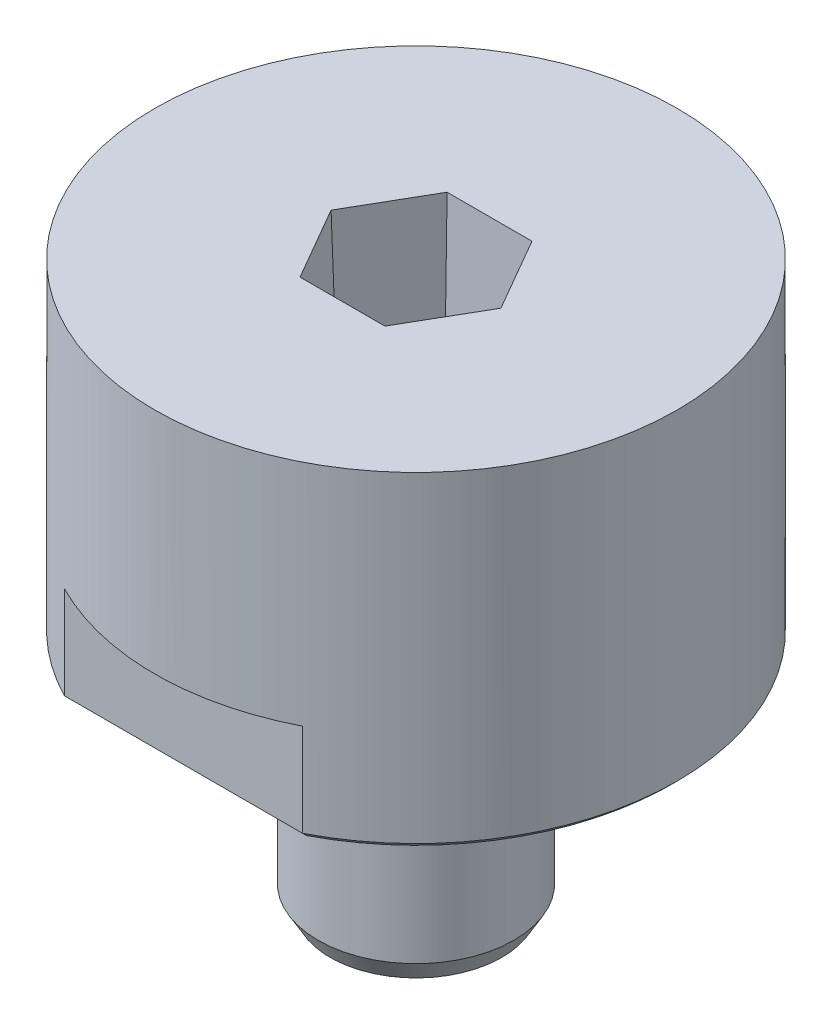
ISO-10303-21;
HEADER;
FILE_DESCRIPTION(('STEP AP214'),'2;1');
FILE_NAME('part.step','',(''),(''),'','','');
FILE_SCHEMA(('AUTOMOTIVE_DESIGN { 1 0 10303 214 1 1 1 1 }'));
ENDSEC;
DATA;
#1=APPLICATION_CONTEXT('core data for automotive mechanical design processes');
#2=APPLICATION_PROTOCOL_DEFINITION('international standard','automotive_design',2000,#1);
#3=PRODUCT_CONTEXT('',#1,'mechanical');
#4=PRODUCT('Part','Part','',(#3));
#5=PRODUCT_RELATED_PRODUCT_CATEGORY('part','',(#4));
#6=PRODUCT_DEFINITION_FORMATION('','',#4);
#7=PRODUCT_DEFINITION_CONTEXT('part definition',#1,'design');
#8=PRODUCT_DEFINITION('design','',#6,#7);
#9=PRODUCT_DEFINITION_SHAPE('','',#8);
#10=(LENGTH_UNIT() NAMED_UNIT(*) SI_UNIT(.MILLI.,.METRE.));
#11=(NAMED_UNIT(*) PLANE_ANGLE_UNIT() SI_UNIT($,.RADIAN.));
#12=(NAMED_UNIT(*) SI_UNIT($,.STERADIAN.) SOLID_ANGLE_UNIT());
#13=UNCERTAINTY_MEASURE_WITH_UNIT(LENGTH_MEASURE(1.E-05),#10,'distance_accuracy_value','');
#14=(GEOMETRIC_REPRESENTATION_CONTEXT(3) GLOBAL_UNCERTAINTY_ASSIGNED_CONTEXT((#13)) GLOBAL_UNIT_ASSIGNED_CONTEXT((#10,
#11,#12)) REPRESENTATION_CONTEXT('',''));
#15=CARTESIAN_POINT('',(0.,0.,0.));
#16=DIRECTION('',(0.,0.,1.));
#17=DIRECTION('',(1.,0.,0.));
#18=AXIS2_PLACEMENT_3D('',#15,#16,#17);
#19=CARTESIAN_POINT('',(0.,7.239,0.));
#20=DIRECTION('',(0.,1.,0.));
#21=DIRECTION('',(0.,0.,1.));
#22=AXIS2_PLACEMENT_3D('',#19,#20,#21);
#23=TOROIDAL_SURFACE('',#22,5.04821796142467,0.127);
#24=CARTESIAN_POINT('',(0.,7.112,0.));
#25=DIRECTION('',(0.,1.,0.));
#26=DIRECTION('',(0.,0.,1.));
#27=AXIS2_PLACEMENT_3D('',#24,#25,#26);
#28=CIRCLE('',#27,5.04821796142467);
#29=CARTESIAN_POINT('',(0.,7.112,5.04821796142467));
#30=VERTEX_POINT('',#29);
#31=EDGE_CURVE('E11',#30,#30,#28,.T.);
#32=ORIENTED_EDGE('',*,*,#31,.T.);
#33=EDGE_LOOP('',(#32));
#34=FACE_BOUND('',#33,.T.);
#35=CARTESIAN_POINT('',(0.,7.239,0.));
#36=DIRECTION('',(0.,1.,0.));
#37=DIRECTION('',(0.,0.,1.));
#38=AXIS2_PLACEMENT_3D('',#35,#36,#37);
#39=CIRCLE('',#38,5.17521796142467);
#40=CARTESIAN_POINT('',(0.,7.239,5.17521796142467));
#41=VERTEX_POINT('',#40);
#42=EDGE_CURVE('E71',#41,#41,#39,.T.);
#43=ORIENTED_EDGE('',*,*,#42,.F.);
#44=EDGE_LOOP('',(#43));
#45=FACE_BOUND('',#44,.T.);
#46=ADVANCED_FACE('F43',(#34,#45),#23,.T.);
#47=CARTESIAN_POINT('',(-5.04821796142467,7.112,0.));
#48=DIRECTION('',(0.,-1.,0.));
#49=DIRECTION('',(0.,0.,-1.));
#50=AXIS2_PLACEMENT_3D('',#47,#48,#49);
#51=PLANE('',#50);
#52=CARTESIAN_POINT('',(0.,7.112,0.));
#53=DIRECTION('',(0.,1.,0.));
#54=DIRECTION('',(0.,0.,1.));
#55=AXIS2_PLACEMENT_3D('',#52,#53,#54);
#56=CIRCLE('',#55,4.67183019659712);
#57=CARTESIAN_POINT('',(0.,7.112,4.67183019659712));
#58=VERTEX_POINT('',#57);
#59=EDGE_CURVE('E49',#58,#58,#56,.T.);
#60=ORIENTED_EDGE('',*,*,#59,.T.);
#61=EDGE_LOOP('',(#60));
#62=FACE_BOUND('',#61,.T.);
#63=ORIENTED_EDGE('',*,*,#31,.F.);
#64=EDGE_LOOP('',(#63));
#65=FACE_BOUND('',#64,.T.);
#66=ADVANCED_FACE('F79',(#62,#65),#51,.T.);
#67=CARTESIAN_POINT('',(0.,7.239,0.));
#68=DIRECTION('',(0.,1.,0.));
#69=DIRECTION('',(0.,0.,1.));
#70=AXIS2_PLACEMENT_3D('',#67,#68,#69);
#71=TOROIDAL_SURFACE('',#70,4.67183019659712,0.127);
#72=CARTESIAN_POINT('',(0.,7.239,0.));
#73=DIRECTION('',(0.,1.,0.));
#74=DIRECTION('',(0.,0.,1.));
#75=AXIS2_PLACEMENT_3D('',#72,#73,#74);
#76=CIRCLE('',#75,4.54483019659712);
#77=CARTESIAN_POINT('',(0.,7.239,4.54483019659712));
#78=VERTEX_POINT('',#77);
#79=EDGE_CURVE('E53',#78,#78,#76,.T.);
#80=ORIENTED_EDGE('',*,*,#79,.T.);
#81=EDGE_LOOP('',(#80));
#82=FACE_BOUND('',#81,.T.);
#83=ORIENTED_EDGE('',*,*,#59,.F.);
#84=EDGE_LOOP('',(#83));
#85=FACE_BOUND('',#84,.T.);
#86=ADVANCED_FACE('F83',(#82,#85),#71,.T.);
#87=CARTESIAN_POINT('',(0.,9.55248222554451,0.));
#88=DIRECTION('',(0.,1.,0.));
#89=DIRECTION('',(0.,0.,1.));
#90=AXIS2_PLACEMENT_3D('',#87,#88,#89);
#91=CYLINDRICAL_SURFACE('',#90,4.54483019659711);
#92=CARTESIAN_POINT('',(0.,7.4422,0.));
#93=DIRECTION('',(0.,1.,0.));
#94=DIRECTION('',(0.,0.,1.));
#95=AXIS2_PLACEMENT_3D('',#92,#93,#94);
#96=CIRCLE('',#95,4.54483019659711);
#97=CARTESIAN_POINT('',(0.,7.4422,4.54483019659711));
#98=VERTEX_POINT('',#97);
#99=EDGE_CURVE('E57',#98,#98,#96,.T.);
#100=ORIENTED_EDGE('',*,*,#99,.T.);
#101=EDGE_LOOP('',(#100));
#102=FACE_BOUND('',#101,.T.);
#103=ORIENTED_EDGE('',*,*,#79,.F.);
#104=EDGE_LOOP('',(#103));
#105=FACE_BOUND('',#104,.T.);
#106=ADVANCED_FACE('F87',(#102,#105),#91,.F.);
#107=CARTESIAN_POINT('',(0.,7.4422,0.));
#108=DIRECTION('',(0.,1.,0.));
#109=DIRECTION('',(0.,0.,1.));
#110=AXIS2_PLACEMENT_3D('',#107,#108,#109);
#111=TOROIDAL_SURFACE('',#110,4.67183019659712,0.127);
#112=CARTESIAN_POINT('',(0.,7.5692,0.));
#113=DIRECTION('',(0.,1.,0.));
#114=DIRECTION('',(0.,0.,1.));
#115=AXIS2_PLACEMENT_3D('',#112,#113,#114);
#116=CIRCLE('',#115,4.67183019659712);
#117=CARTESIAN_POINT('',(0.,7.5692,4.67183019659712));
#118=VERTEX_POINT('',#117);
#119=EDGE_CURVE('E62',#118,#118,#116,.T.);
#120=ORIENTED_EDGE('',*,*,#119,.T.);
#121=EDGE_LOOP('',(#120));
#122=FACE_BOUND('',#121,.T.);
#123=ORIENTED_EDGE('',*,*,#99,.F.);
#124=EDGE_LOOP('',(#123));
#125=FACE_BOUND('',#124,.T.);
#126=ADVANCED_FACE('F94',(#122,#125),#111,.T.);
#127=CARTESIAN_POINT('',(-4.67183019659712,7.5692,0.));
#128=DIRECTION('',(0.,1.,0.));
#129=DIRECTION('',(0.,0.,1.));
#130=AXIS2_PLACEMENT_3D('',#127,#128,#129);
#131=PLANE('',#130);
#132=CARTESIAN_POINT('',(0.,7.5692,0.));
#133=DIRECTION('',(0.,1.,0.));
#134=DIRECTION('',(0.,0.,1.));
#135=AXIS2_PLACEMENT_3D('',#132,#133,#134);
#136=CIRCLE('',#135,5.04821796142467);
#137=CARTESIAN_POINT('',(0.,7.5692,5.04821796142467));
#138=VERTEX_POINT('',#137);
#139=EDGE_CURVE('E65',#138,#138,#136,.T.);
#140=ORIENTED_EDGE('',*,*,#139,.T.);
#141=EDGE_LOOP('',(#140));
#142=FACE_BOUND('',#141,.T.);
#143=ORIENTED_EDGE('',*,*,#119,.F.);
#144=EDGE_LOOP('',(#143));
#145=FACE_BOUND('',#144,.T.);
#146=ADVANCED_FACE('F98',(#142,#145),#131,.T.);
#147=CARTESIAN_POINT('',(0.,7.4422,0.));
#148=DIRECTION('',(0.,1.,0.));
#149=DIRECTION('',(0.,0.,1.));
#150=AXIS2_PLACEMENT_3D('',#147,#148,#149);
#151=TOROIDAL_SURFACE('',#150,5.04821796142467,0.127);
#152=CARTESIAN_POINT('',(0.,7.4422,0.));
#153=DIRECTION('',(0.,1.,0.));
#154=DIRECTION('',(0.,0.,1.));
#155=AXIS2_PLACEMENT_3D('',#152,#153,#154);
#156=CIRCLE('',#155,5.17521796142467);
#157=CARTESIAN_POINT('',(0.,7.4422,5.17521796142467));
#158=VERTEX_POINT('',#157);
#159=EDGE_CURVE('E68',#158,#158,#156,.T.);
#160=ORIENTED_EDGE('',*,*,#159,.T.);
#161=EDGE_LOOP('',(#160));
#162=FACE_BOUND('',#161,.T.);
#163=ORIENTED_EDGE('',*,*,#139,.F.);
#164=EDGE_LOOP('',(#163));
#165=FACE_BOUND('',#164,.T.);
#166=ADVANCED_FACE('F102',(#162,#165),#151,.T.);
#167=CARTESIAN_POINT('',(0.,9.55248222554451,0.));
#168=DIRECTION('',(0.,1.,0.));
#169=DIRECTION('',(0.,0.,1.));
#170=AXIS2_PLACEMENT_3D('',#167,#168,#169);
#171=CYLINDRICAL_SURFACE('',#170,5.17521796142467);
#172=ORIENTED_EDGE('',*,*,#42,.T.);
#173=EDGE_LOOP('',(#172));
#174=FACE_BOUND('',#173,.T.);
#175=ORIENTED_EDGE('',*,*,#159,.F.);
#176=EDGE_LOOP('',(#175));
#177=FACE_BOUND('',#176,.T.);
#178=ADVANCED_FACE('F75',(#174,#177),#171,.T.);
#179=CLOSED_SHELL('',(#46,#66,#86,#106,#126,#146,#166,#178));
#180=MANIFOLD_SOLID_BREP('B2',#179);
#181=CARTESIAN_POINT('',(12.69746,27.305,0.));
#182=DIRECTION('',(0.,1.,0.));
#183=DIRECTION('',(0.,0.,1.));
#184=AXIS2_PLACEMENT_3D('',#181,#182,#183);
#185=PLANE('',#184);
#186=DIRECTION('',(0.5,0.,0.866025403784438));
#187=VECTOR('',#186,1.);
#188=CARTESIAN_POINT('',(6.2696648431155,27.305,3.71108926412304));
#189=LINE('',#188,#187);
#190=CARTESIAN_POINT('',(4.12706645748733,27.305,0.));
#191=VERTEX_POINT('',#190);
#192=CARTESIAN_POINT('',(2.06353322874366,27.305,-3.57414439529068));
#193=VERTEX_POINT('',#192);
#194=EDGE_CURVE('E244',#191,#193,#189,.F.);
#195=ORIENTED_EDGE('',*,*,#194,.F.);
#196=DIRECTION('',(-0.5,0.,0.866025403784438));
#197=VECTOR('',#196,1.);
#198=CARTESIAN_POINT('',(6.2696648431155,27.305,-3.71108926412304));
#199=LINE('',#198,#197);
#200=CARTESIAN_POINT('',(2.06353322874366,27.305,3.57414439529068));
#201=VERTEX_POINT('',#200);
#202=EDGE_CURVE('E237',#201,#191,#199,.F.);
#203=ORIENTED_EDGE('',*,*,#202,.F.);
#204=DIRECTION('',(-1.,0.,0.));
#205=VECTOR('',#204,1.);
#206=CARTESIAN_POINT('',(12.69746,27.305,3.57414439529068));
#207=LINE('',#206,#205);
#208=CARTESIAN_POINT('',(-2.06353322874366,27.305,3.57414439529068));
#209=VERTEX_POINT('',#208);
#210=EDGE_CURVE('E168',#209,#201,#207,.F.);
#211=ORIENTED_EDGE('',*,*,#210,.F.);
#212=DIRECTION('',(-0.5,0.,-0.866025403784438));
#213=VECTOR('',#212,1.);
#214=CARTESIAN_POINT('',(0.0790651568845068,27.305,7.28523365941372));
#215=LINE('',#214,#213);
#216=CARTESIAN_POINT('',(-4.12706645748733,27.305,0.));
#217=VERTEX_POINT('',#216);
#218=EDGE_CURVE('E227',#217,#209,#215,.F.);
#219=ORIENTED_EDGE('',*,*,#218,.F.);
#220=DIRECTION('',(0.5,0.,-0.866025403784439));
#221=VECTOR('',#220,1.);
#222=CARTESIAN_POINT('',(0.0790651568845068,27.305,-7.28523365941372));
#223=LINE('',#222,#221);
#224=CARTESIAN_POINT('',(-2.06353322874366,27.305,-3.57414439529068));
#225=VERTEX_POINT('',#224);
#226=EDGE_CURVE('E233',#225,#217,#223,.F.);
#227=ORIENTED_EDGE('',*,*,#226,.F.);
#228=DIRECTION('',(1.,0.,0.));
#229=VECTOR('',#228,1.);
#230=CARTESIAN_POINT('',(12.69746,27.305,-3.57414439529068));
#231=LINE('',#230,#229);
#232=EDGE_CURVE('E246',#193,#225,#231,.F.);
#233=ORIENTED_EDGE('',*,*,#232,.F.);
#234=EDGE_LOOP('',(#195,#203,#211,#219,#227,#233));
#235=FACE_BOUND('',#234,.T.);
#236=CARTESIAN_POINT('',(0.,27.305,0.));
#237=DIRECTION('',(0.,-1.,0.));
#238=DIRECTION('',(0.,0.,-1.));
#239=AXIS2_PLACEMENT_3D('',#236,#237,#238);
#240=CIRCLE('',#239,12.69746);
#241=CARTESIAN_POINT('',(0.,27.305,-12.69746));
#242=VERTEX_POINT('',#241);
#243=EDGE_CURVE('E457',#242,#242,#240,.T.);
#244=ORIENTED_EDGE('',*,*,#243,.F.);
#245=EDGE_LOOP('',(#244));
#246=FACE_BOUND('',#245,.T.);
#247=ADVANCED_FACE('F164',(#235,#246),#185,.T.);
#248=CARTESIAN_POINT('',(0.,0.,0.));
#249=DIRECTION('',(0.,-1.,0.));
#250=DIRECTION('',(0.,0.,-1.));
#251=AXIS2_PLACEMENT_3D('',#248,#249,#250);
#252=CYLINDRICAL_SURFACE('',#251,12.69746);
#253=DIRECTION('',(0.,-1.,0.));
#254=VECTOR('',#253,1.);
#255=CARTESIAN_POINT('',(-5.78512588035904,16.1925,-11.303));
#256=LINE('',#255,#254);
#257=CARTESIAN_POINT('',(-5.78512588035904,16.1925,-11.303));
#258=VERTEX_POINT('',#257);
#259=CARTESIAN_POINT('',(-5.78512588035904,11.684,-11.303));
#260=VERTEX_POINT('',#259);
#261=EDGE_CURVE('E417',#258,#260,#256,.T.);
#262=ORIENTED_EDGE('',*,*,#261,.T.);
#263=CARTESIAN_POINT('',(0.,11.684,0.));
#264=DIRECTION('',(0.,-1.,0.));
#265=DIRECTION('',(0.,0.,-1.));
#266=AXIS2_PLACEMENT_3D('',#263,#264,#265);
#267=CIRCLE('',#266,12.69746);
#268=CARTESIAN_POINT('',(-5.78512588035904,11.684,11.303));
#269=VERTEX_POINT('',#268);
#270=EDGE_CURVE('E174',#260,#269,#267,.F.);
#271=ORIENTED_EDGE('',*,*,#270,.T.);
#272=DIRECTION('',(0.,-1.,0.));
#273=VECTOR('',#272,1.);
#274=CARTESIAN_POINT('',(-5.78512588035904,16.1925,11.303));
#275=LINE('',#274,#273);
#276=CARTESIAN_POINT('',(-5.78512588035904,16.1925,11.303));
#277=VERTEX_POINT('',#276);
#278=EDGE_CURVE('E420',#277,#269,#275,.T.);
#279=ORIENTED_EDGE('',*,*,#278,.F.);
#280=CARTESIAN_POINT('',(0.,16.1925,0.));
#281=DIRECTION('',(0.,-1.,0.));
#282=DIRECTION('',(0.,0.,-1.));
#283=AXIS2_PLACEMENT_3D('',#280,#281,#282);
#284=CIRCLE('',#283,12.69746);
#285=CARTESIAN_POINT('',(5.78512588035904,16.1925,11.303));
#286=VERTEX_POINT('',#285);
#287=EDGE_CURVE('E414',#286,#277,#284,.T.);
#288=ORIENTED_EDGE('',*,*,#287,.F.);
#289=DIRECTION('',(0.,-1.,0.));
#290=VECTOR('',#289,1.);
#291=CARTESIAN_POINT('',(5.78512588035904,16.1925,11.303));
#292=LINE('',#291,#290);
#293=CARTESIAN_POINT('',(5.78512588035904,11.684,11.303));
#294=VERTEX_POINT('',#293);
#295=EDGE_CURVE('E421',#286,#294,#292,.T.);
#296=ORIENTED_EDGE('',*,*,#295,.T.);
#297=CARTESIAN_POINT('',(0.,11.684,0.));
#298=DIRECTION('',(0.,-1.,0.));
#299=DIRECTION('',(0.,0.,-1.));
#300=AXIS2_PLACEMENT_3D('',#297,#298,#299);
#301=CIRCLE('',#300,12.69746);
#302=CARTESIAN_POINT('',(5.78512588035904,11.684,-11.303));
#303=VERTEX_POINT('',#302);
#304=EDGE_CURVE('E469',#294,#303,#301,.F.);
#305=ORIENTED_EDGE('',*,*,#304,.T.);
#306=DIRECTION('',(0.,-1.,0.));
#307=VECTOR('',#306,1.);
#308=CARTESIAN_POINT('',(5.78512588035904,16.1925,-11.303));
#309=LINE('',#308,#307);
#310=CARTESIAN_POINT('',(5.78512588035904,16.1925,-11.303));
#311=VERTEX_POINT('',#310);
#312=EDGE_CURVE('E430',#311,#303,#309,.T.);
#313=ORIENTED_EDGE('',*,*,#312,.F.);
#314=CARTESIAN_POINT('',(0.,16.1925,0.));
#315=DIRECTION('',(0.,-1.,0.));
#316=DIRECTION('',(0.,0.,-1.));
#317=AXIS2_PLACEMENT_3D('',#314,#315,#316);
#318=CIRCLE('',#317,12.69746);
#319=EDGE_CURVE('E254',#258,#311,#318,.T.);
#320=ORIENTED_EDGE('',*,*,#319,.F.);
#321=EDGE_LOOP('',(#262,#271,#279,#288,#296,#305,#313,#320));
#322=FACE_BOUND('',#321,.T.);
#323=ORIENTED_EDGE('',*,*,#243,.T.);
#324=EDGE_LOOP('',(#323));
#325=FACE_BOUND('',#324,.T.);
#326=ADVANCED_FACE('F314',(#322,#325),#252,.T.);
#327=CARTESIAN_POINT('',(5.5245,11.43,0.));
#328=DIRECTION('',(0.,-1.,0.));
#329=DIRECTION('',(0.,0.,-1.));
#330=AXIS2_PLACEMENT_3D('',#327,#328,#329);
#331=PLANE('',#330);
#332=CARTESIAN_POINT('',(0.,11.43,0.));
#333=DIRECTION('',(0.,-1.,0.));
#334=DIRECTION('',(0.,0.,-1.));
#335=AXIS2_PLACEMENT_3D('',#332,#333,#334);
#336=CIRCLE('',#335,12.44346);
#337=CARTESIAN_POINT('',(-5.72357368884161,11.43,11.049));
#338=VERTEX_POINT('',#337);
#339=CARTESIAN_POINT('',(-5.72357368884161,11.43,-11.049));
#340=VERTEX_POINT('',#339);
#341=EDGE_CURVE('E360',#338,#340,#336,.T.);
#342=ORIENTED_EDGE('',*,*,#341,.T.);
#343=DIRECTION('',(1.,0.,0.));
#344=VECTOR('',#343,1.);
#345=CARTESIAN_POINT('',(5.78512588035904,11.43,-11.049));
#346=LINE('',#345,#344);
#347=CARTESIAN_POINT('',(5.72357368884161,11.43,-11.049));
#348=VERTEX_POINT('',#347);
#349=EDGE_CURVE('E466',#340,#348,#346,.T.);
#350=ORIENTED_EDGE('',*,*,#349,.T.);
#351=CARTESIAN_POINT('',(0.,11.43,0.));
#352=DIRECTION('',(0.,-1.,0.));
#353=DIRECTION('',(0.,0.,-1.));
#354=AXIS2_PLACEMENT_3D('',#351,#352,#353);
#355=CIRCLE('',#354,12.44346);
#356=CARTESIAN_POINT('',(5.72357368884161,11.43,11.049));
#357=VERTEX_POINT('',#356);
#358=EDGE_CURVE('E462',#348,#357,#355,.T.);
#359=ORIENTED_EDGE('',*,*,#358,.T.);
#360=DIRECTION('',(-1.,0.,0.));
#361=VECTOR('',#360,1.);
#362=CARTESIAN_POINT('',(-5.78512588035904,11.43,11.049));
#363=LINE('',#362,#361);
#364=EDGE_CURVE('E366',#357,#338,#363,.T.);
#365=ORIENTED_EDGE('',*,*,#364,.T.);
#366=EDGE_LOOP('',(#342,#350,#359,#365));
#367=FACE_BOUND('',#366,.T.);
#368=CARTESIAN_POINT('',(1.22298005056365E-13,11.43,-9.906));
#369=DIRECTION('',(0.,-1.,0.));
#370=DIRECTION('',(-0.707106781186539,0.,-0.707106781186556));
#371=AXIS2_PLACEMENT_3D('',#368,#369,#370);
#372=CIRCLE('',#371,0.898384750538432);
#373=CARTESIAN_POINT('',(-0.63525394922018,11.43,-10.5412539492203));
#374=VERTEX_POINT('',#373);
#375=EDGE_CURVE('E271',#374,#374,#372,.T.);
#376=ORIENTED_EDGE('',*,*,#375,.F.);
#377=EDGE_LOOP('',(#376));
#378=FACE_BOUND('',#377,.T.);
#379=CARTESIAN_POINT('',(-7.00459977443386,11.43,-7.00459977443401));
#380=DIRECTION('',(0.,-1.,0.));
#381=DIRECTION('',(-1.,0.,0.));
#382=AXIS2_PLACEMENT_3D('',#379,#380,#381);
#383=CIRCLE('',#382,0.898384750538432);
#384=CARTESIAN_POINT('',(-7.9029845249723,11.43,-7.00459977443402));
#385=VERTEX_POINT('',#384);
#386=EDGE_CURVE('E488',#385,#385,#383,.T.);
#387=ORIENTED_EDGE('',*,*,#386,.F.);
#388=EDGE_LOOP('',(#387));
#389=FACE_BOUND('',#388,.T.);
#390=CARTESIAN_POINT('',(-9.906,11.43,0.));
#391=DIRECTION('',(0.,-1.,0.));
#392=DIRECTION('',(-0.707106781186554,0.,0.707106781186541));
#393=AXIS2_PLACEMENT_3D('',#390,#391,#392);
#394=CIRCLE('',#393,0.898384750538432);
#395=CARTESIAN_POINT('',(-10.5412539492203,11.43,0.635253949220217));
#396=VERTEX_POINT('',#395);
#397=EDGE_CURVE('E492',#396,#396,#394,.T.);
#398=ORIENTED_EDGE('',*,*,#397,.F.);
#399=EDGE_LOOP('',(#398));
#400=FACE_BOUND('',#399,.T.);
#401=CARTESIAN_POINT('',(-7.00459977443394,11.43,7.00459977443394));
#402=DIRECTION('',(0.,-1.,0.));
#403=DIRECTION('',(0.,0.,1.));
#404=AXIS2_PLACEMENT_3D('',#401,#402,#403);
#405=CIRCLE('',#404,0.898384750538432);
#406=CARTESIAN_POINT('',(-7.00459977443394,11.43,7.90298452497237));
#407=VERTEX_POINT('',#406);
#408=EDGE_CURVE('E496',#407,#407,#405,.T.);
#409=ORIENTED_EDGE('',*,*,#408,.F.);
#410=EDGE_LOOP('',(#409));
#411=FACE_BOUND('',#410,.T.);
#412=CARTESIAN_POINT('',(0.,11.43,9.906));
#413=DIRECTION('',(0.,-1.,0.));
#414=DIRECTION('',(0.707106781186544,0.,0.707106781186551));
#415=AXIS2_PLACEMENT_3D('',#412,#413,#414);
#416=CIRCLE('',#415,0.898384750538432);
#417=CARTESIAN_POINT('',(0.635253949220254,11.43,10.5412539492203));
#418=VERTEX_POINT('',#417);
#419=EDGE_CURVE('E500',#418,#418,#416,.T.);
#420=ORIENTED_EDGE('',*,*,#419,.F.);
#421=EDGE_LOOP('',(#420));
#422=FACE_BOUND('',#421,.T.);
#423=CARTESIAN_POINT('',(7.00459977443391,11.43,7.00459977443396));
#424=DIRECTION('',(0.,-1.,0.));
#425=DIRECTION('',(1.,0.,0.));
#426=AXIS2_PLACEMENT_3D('',#423,#424,#425);
#427=CIRCLE('',#426,0.898384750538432);
#428=CARTESIAN_POINT('',(7.90298452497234,11.43,7.00459977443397));
#429=VERTEX_POINT('',#428);
#430=EDGE_CURVE('E504',#429,#429,#427,.T.);
#431=ORIENTED_EDGE('',*,*,#430,.F.);
#432=EDGE_LOOP('',(#431));
#433=FACE_BOUND('',#432,.T.);
#434=CARTESIAN_POINT('',(9.906,11.43,0.));
#435=DIRECTION('',(0.,-1.,0.));
#436=DIRECTION('',(0.707106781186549,0.,-0.707106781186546));
#437=AXIS2_PLACEMENT_3D('',#434,#435,#436);
#438=CIRCLE('',#437,0.898384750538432);
#439=CARTESIAN_POINT('',(10.5412539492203,11.43,-0.635253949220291));
#440=VERTEX_POINT('',#439);
#441=EDGE_CURVE('E508',#440,#440,#438,.T.);
#442=ORIENTED_EDGE('',*,*,#441,.F.);
#443=EDGE_LOOP('',(#442));
#444=FACE_BOUND('',#443,.T.);
#445=CARTESIAN_POINT('',(7.00459977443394,11.43,-7.00459977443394));
#446=DIRECTION('',(0.,-1.,0.));
#447=DIRECTION('',(0.,0.,-1.));
#448=AXIS2_PLACEMENT_3D('',#445,#446,#447);
#449=CIRCLE('',#448,0.898384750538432);
#450=CARTESIAN_POINT('',(7.00459977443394,11.43,-7.90298452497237));
#451=VERTEX_POINT('',#450);
#452=EDGE_CURVE('E247',#451,#451,#449,.T.);
#453=ORIENTED_EDGE('',*,*,#452,.F.);
#454=EDGE_LOOP('',(#453));
#455=FACE_BOUND('',#454,.T.);
#456=CARTESIAN_POINT('',(0.,11.43,0.));
#457=DIRECTION('',(0.,-1.,0.));
#458=DIRECTION('',(0.,0.,-1.));
#459=AXIS2_PLACEMENT_3D('',#456,#457,#458);
#460=CIRCLE('',#459,5.5245);
#461=CARTESIAN_POINT('',(0.,11.43,-5.5245));
#462=VERTEX_POINT('',#461);
#463=EDGE_CURVE('E454',#462,#462,#460,.T.);
#464=ORIENTED_EDGE('',*,*,#463,.F.);
#465=EDGE_LOOP('',(#464));
#466=FACE_BOUND('',#465,.T.);
#467=ADVANCED_FACE('F319',(#367,#378,#389,#400,#411,#422,#433,#444,#455,#466),#331,.T.);
#468=CARTESIAN_POINT('',(0.,10.668,0.));
#469=DIRECTION('',(0.,-1.,0.));
#470=DIRECTION('',(0.,0.,-1.));
#471=AXIS2_PLACEMENT_3D('',#468,#469,#470);
#472=TOROIDAL_SURFACE('',#471,5.5245,0.762);
#473=ORIENTED_EDGE('',*,*,#463,.T.);
#474=EDGE_LOOP('',(#473));
#475=FACE_BOUND('',#474,.T.);
#476=CARTESIAN_POINT('',(0.,10.668,0.));
#477=DIRECTION('',(0.,-1.,0.));
#478=DIRECTION('',(0.,0.,-1.));
#479=AXIS2_PLACEMENT_3D('',#476,#477,#478);
#480=CIRCLE('',#479,4.7625);
#481=CARTESIAN_POINT('',(0.,10.668,-4.7625));
#482=VERTEX_POINT('',#481);
#483=EDGE_CURVE('E451',#482,#482,#480,.T.);
#484=ORIENTED_EDGE('',*,*,#483,.F.);
#485=EDGE_LOOP('',(#484));
#486=FACE_BOUND('',#485,.T.);
#487=ADVANCED_FACE('F481',(#475,#486),#472,.F.);
#488=CARTESIAN_POINT('',(0.,0.,0.));
#489=DIRECTION('',(0.,-1.,0.));
#490=DIRECTION('',(0.,0.,-1.));
#491=AXIS2_PLACEMENT_3D('',#488,#489,#490);
#492=CYLINDRICAL_SURFACE('',#491,4.7625);
#493=ORIENTED_EDGE('',*,*,#483,.T.);
#494=EDGE_LOOP('',(#493));
#495=FACE_BOUND('',#494,.T.);
#496=CARTESIAN_POINT('',(0.,7.5692,0.));
#497=DIRECTION('',(0.,-1.,0.));
#498=DIRECTION('',(0.,0.,-1.));
#499=AXIS2_PLACEMENT_3D('',#496,#497,#498);
#500=CIRCLE('',#499,4.7625);
#501=CARTESIAN_POINT('',(0.,7.5692,-4.7625));
#502=VERTEX_POINT('',#501);
#503=EDGE_CURVE('E448',#502,#502,#500,.T.);
#504=ORIENTED_EDGE('',*,*,#503,.F.);
#505=EDGE_LOOP('',(#504));
#506=FACE_BOUND('',#505,.T.);
#507=ADVANCED_FACE('F516',(#495,#506),#492,.T.);
#508=CARTESIAN_POINT('',(4.7625,7.5692,0.));
#509=DIRECTION('',(0.,-1.,0.));
#510=DIRECTION('',(0.,0.,-1.));
#511=AXIS2_PLACEMENT_3D('',#508,#509,#510);
#512=PLANE('',#511);
#513=ORIENTED_EDGE('',*,*,#503,.T.);
#514=EDGE_LOOP('',(#513));
#515=FACE_BOUND('',#514,.T.);
#516=CARTESIAN_POINT('',(0.,7.5692,0.));
#517=DIRECTION('',(0.,-1.,0.));
#518=DIRECTION('',(0.,0.,-1.));
#519=AXIS2_PLACEMENT_3D('',#516,#517,#518);
#520=CIRCLE('',#519,4.4577);
#521=CARTESIAN_POINT('',(0.,7.5692,-4.4577));
#522=VERTEX_POINT('',#521);
#523=EDGE_CURVE('E445',#522,#522,#520,.T.);
#524=ORIENTED_EDGE('',*,*,#523,.F.);
#525=EDGE_LOOP('',(#524));
#526=FACE_BOUND('',#525,.T.);
#527=ADVANCED_FACE('F522',(#515,#526),#512,.T.);
#528=CARTESIAN_POINT('',(0.,0.,0.));
#529=DIRECTION('',(0.,-1.,0.));
#530=DIRECTION('',(0.,0.,-1.));
#531=AXIS2_PLACEMENT_3D('',#528,#529,#530);
#532=CYLINDRICAL_SURFACE('',#531,4.4577);
#533=ORIENTED_EDGE('',*,*,#523,.T.);
#534=EDGE_LOOP('',(#533));
#535=FACE_BOUND('',#534,.T.);
#536=CARTESIAN_POINT('',(0.,7.112,0.));
#537=DIRECTION('',(0.,-1.,0.));
#538=DIRECTION('',(0.,0.,-1.));
#539=AXIS2_PLACEMENT_3D('',#536,#537,#538);
#540=CIRCLE('',#539,4.4577);
#541=CARTESIAN_POINT('',(0.,7.112,-4.4577));
#542=VERTEX_POINT('',#541);
#543=EDGE_CURVE('E442',#542,#542,#540,.T.);
#544=ORIENTED_EDGE('',*,*,#543,.F.);
#545=EDGE_LOOP('',(#544));
#546=FACE_BOUND('',#545,.T.);
#547=ADVANCED_FACE('F528',(#535,#546),#532,.T.);
#548=CARTESIAN_POINT('',(4.4577,7.112,0.));
#549=DIRECTION('',(0.,1.,0.));
#550=DIRECTION('',(0.,0.,1.));
#551=AXIS2_PLACEMENT_3D('',#548,#549,#550);
#552=PLANE('',#551);
#553=ORIENTED_EDGE('',*,*,#543,.T.);
#554=EDGE_LOOP('',(#553));
#555=FACE_BOUND('',#554,.T.);
#556=CARTESIAN_POINT('',(0.,7.112,0.));
#557=DIRECTION('',(0.,-1.,0.));
#558=DIRECTION('',(0.,0.,-1.));
#559=AXIS2_PLACEMENT_3D('',#556,#557,#558);
#560=CIRCLE('',#559,4.7625);
#561=CARTESIAN_POINT('',(0.,7.112,-4.7625));
#562=VERTEX_POINT('',#561);
#563=EDGE_CURVE('E439',#562,#562,#560,.T.);
#564=ORIENTED_EDGE('',*,*,#563,.F.);
#565=EDGE_LOOP('',(#564));
#566=FACE_BOUND('',#565,.T.);
#567=ADVANCED_FACE('F534',(#555,#566),#552,.T.);
#568=CARTESIAN_POINT('',(0.,0.,0.));
#569=DIRECTION('',(0.,-1.,0.));
#570=DIRECTION('',(0.,0.,-1.));
#571=AXIS2_PLACEMENT_3D('',#568,#569,#570);
#572=CYLINDRICAL_SURFACE('',#571,4.7625);
#573=ORIENTED_EDGE('',*,*,#563,.T.);
#574=EDGE_LOOP('',(#573));
#575=FACE_BOUND('',#574,.T.);
#576=CARTESIAN_POINT('',(0.,1.016,0.));
#577=DIRECTION('',(0.,-1.,0.));
#578=DIRECTION('',(0.,0.,-1.));
#579=AXIS2_PLACEMENT_3D('',#576,#577,#578);
#580=CIRCLE('',#579,4.7625);
#581=CARTESIAN_POINT('',(0.,1.016,-4.7625));
#582=VERTEX_POINT('',#581);
#583=EDGE_CURVE('E436',#582,#582,#580,.T.);
#584=ORIENTED_EDGE('',*,*,#583,.F.);
#585=EDGE_LOOP('',(#584));
#586=FACE_BOUND('',#585,.T.);
#587=ADVANCED_FACE('F540',(#575,#586),#572,.T.);
#588=CARTESIAN_POINT('',(0.,0.,0.));
#589=DIRECTION('',(0.,1.,0.));
#590=DIRECTION('',(0.,0.,1.));
#591=AXIS2_PLACEMENT_3D('',#588,#589,#590);
#592=CONICAL_SURFACE('',#591,4.17591212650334,0.523598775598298);
#593=ORIENTED_EDGE('',*,*,#583,.T.);
#594=EDGE_LOOP('',(#593));
#595=FACE_BOUND('',#594,.T.);
#596=CARTESIAN_POINT('',(0.,0.,0.));
#597=DIRECTION('',(0.,-1.,0.));
#598=DIRECTION('',(0.,0.,-1.));
#599=AXIS2_PLACEMENT_3D('',#596,#597,#598);
#600=CIRCLE('',#599,4.17591212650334);
#601=CARTESIAN_POINT('',(0.,0.,-4.17591212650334));
#602=VERTEX_POINT('',#601);
#603=EDGE_CURVE('E424',#602,#602,#600,.T.);
#604=ORIENTED_EDGE('',*,*,#603,.F.);
#605=EDGE_LOOP('',(#604));
#606=FACE_BOUND('',#605,.T.);
#607=ADVANCED_FACE('F546',(#595,#606),#592,.T.);
#608=CARTESIAN_POINT('',(0.,0.,0.));
#609=DIRECTION('',(0.,-1.,0.));
#610=DIRECTION('',(0.,0.,-1.));
#611=AXIS2_PLACEMENT_3D('',#608,#609,#610);
#612=PLANE('',#611);
#613=ORIENTED_EDGE('',*,*,#603,.T.);
#614=EDGE_LOOP('',(#613));
#615=FACE_BOUND('',#614,.T.);
#616=ADVANCED_FACE('F552',(#615),#612,.T.);
#617=CARTESIAN_POINT('',(-5.78512588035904,16.1925,-11.303));
#618=DIRECTION('',(0.,0.,1.));
#619=DIRECTION('',(1.,0.,0.));
#620=AXIS2_PLACEMENT_3D('',#617,#618,#619);
#621=PLANE('',#620);
#622=ORIENTED_EDGE('',*,*,#312,.T.);
#623=DIRECTION('',(-1.,0.,0.));
#624=VECTOR('',#623,1.);
#625=CARTESIAN_POINT('',(-5.78512588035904,11.684,-11.303));
#626=LINE('',#625,#624);
#627=EDGE_CURVE('E460',#303,#260,#626,.T.);
#628=ORIENTED_EDGE('',*,*,#627,.T.);
#629=ORIENTED_EDGE('',*,*,#261,.F.);
#630=DIRECTION('',(-1.,0.,0.));
#631=VECTOR('',#630,1.);
#632=CARTESIAN_POINT('',(-5.78512588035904,16.1925,-11.303));
#633=LINE('',#632,#631);
#634=EDGE_CURVE('E427',#311,#258,#633,.T.);
#635=ORIENTED_EDGE('',*,*,#634,.F.);
#636=EDGE_LOOP('',(#622,#628,#629,#635));
#637=FACE_BOUND('',#636,.T.);
#638=ADVANCED_FACE('F478',(#637),#621,.F.);
#639=CARTESIAN_POINT('',(0.,16.1925,0.));
#640=DIRECTION('',(0.,-1.,0.));
#641=DIRECTION('',(0.,0.,-1.));
#642=AXIS2_PLACEMENT_3D('',#639,#640,#641);
#643=PLANE('',#642);
#644=ORIENTED_EDGE('',*,*,#319,.T.);
#645=ORIENTED_EDGE('',*,*,#634,.T.);
#646=EDGE_LOOP('',(#644,#645));
#647=FACE_BOUND('',#646,.T.);
#648=ADVANCED_FACE('F561',(#647),#643,.T.);
#649=CARTESIAN_POINT('',(-5.78512588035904,16.1925,11.303));
#650=DIRECTION('',(0.,0.,-1.));
#651=DIRECTION('',(-1.,0.,0.));
#652=AXIS2_PLACEMENT_3D('',#649,#650,#651);
#653=PLANE('',#652);
#654=ORIENTED_EDGE('',*,*,#278,.T.);
#655=DIRECTION('',(1.,0.,0.));
#656=VECTOR('',#655,1.);
#657=CARTESIAN_POINT('',(5.78512588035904,11.684,11.303));
#658=LINE('',#657,#656);
#659=EDGE_CURVE('E41',#269,#294,#658,.T.);
#660=ORIENTED_EDGE('',*,*,#659,.T.);
#661=ORIENTED_EDGE('',*,*,#295,.F.);
#662=DIRECTION('',(1.,0.,0.));
#663=VECTOR('',#662,1.);
#664=CARTESIAN_POINT('',(-5.78512588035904,16.1925,11.303));
#665=LINE('',#664,#663);
#666=EDGE_CURVE('E416',#277,#286,#665,.T.);
#667=ORIENTED_EDGE('',*,*,#666,.F.);
#668=EDGE_LOOP('',(#654,#660,#661,#667));
#669=FACE_BOUND('',#668,.T.);
#670=ADVANCED_FACE('F566',(#669),#653,.F.);
#671=CARTESIAN_POINT('',(0.,16.1925,0.));
#672=DIRECTION('',(0.,-1.,0.));
#673=DIRECTION('',(0.,0.,-1.));
#674=AXIS2_PLACEMENT_3D('',#671,#672,#673);
#675=PLANE('',#674);
#676=ORIENTED_EDGE('',*,*,#287,.T.);
#677=ORIENTED_EDGE('',*,*,#666,.T.);
#678=EDGE_LOOP('',(#676,#677));
#679=FACE_BOUND('',#678,.T.);
#680=ADVANCED_FACE('F307',(#679),#675,.T.);
#681=CARTESIAN_POINT('',(3.66617420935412,15.875,0.));
#682=DIRECTION('',(-0.865497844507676,0.034899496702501,0.499695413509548));
#683=DIRECTION('',(0.5,0.,0.866025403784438));
#684=AXIS2_PLACEMENT_3D('',#681,#682,#683);
#685=PLANE('',#684);
#686=ORIENTED_EDGE('',*,*,#194,.T.);
#687=DIRECTION('',(0.0201451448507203,0.999188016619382,-0.0348924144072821));
#688=VECTOR('',#687,1.);
#689=CARTESIAN_POINT('',(1.83159927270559,15.8012043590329,-3.17242299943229));
#690=LINE('',#689,#688);
#691=CARTESIAN_POINT('',(1.83308710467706,15.875,-3.175));
#692=VERTEX_POINT('',#691);
#693=EDGE_CURVE('E255',#692,#193,#690,.T.);
#694=ORIENTED_EDGE('',*,*,#693,.F.);
#695=DIRECTION('',(-0.5,0.,-0.866025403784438));
#696=VECTOR('',#695,1.);
#697=CARTESIAN_POINT('',(3.66617420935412,15.875,0.));
#698=LINE('',#697,#696);
#699=CARTESIAN_POINT('',(3.66617420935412,15.875,0.));
#700=VERTEX_POINT('',#699);
#701=EDGE_CURVE('E238',#700,#692,#698,.T.);
#702=ORIENTED_EDGE('',*,*,#701,.F.);
#703=DIRECTION('',(0.0402902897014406,0.999188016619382,0.));
#704=VECTOR('',#703,1.);
#705=CARTESIAN_POINT('',(3.66319854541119,15.8012043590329,0.));
#706=LINE('',#705,#704);
#707=EDGE_CURVE('E252',#700,#191,#706,.T.);
#708=ORIENTED_EDGE('',*,*,#707,.T.);
#709=EDGE_LOOP('',(#686,#694,#702,#708));
#710=FACE_BOUND('',#709,.T.);
#711=ADVANCED_FACE('F304',(#710),#685,.T.);
#712=CARTESIAN_POINT('',(1.83308710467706,15.875,3.175));
#713=DIRECTION('',(-0.865497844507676,0.034899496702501,-0.499695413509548));
#714=DIRECTION('',(-0.5,0.,0.866025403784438));
#715=AXIS2_PLACEMENT_3D('',#712,#713,#714);
#716=PLANE('',#715);
#717=ORIENTED_EDGE('',*,*,#202,.T.);
#718=ORIENTED_EDGE('',*,*,#707,.F.);
#719=DIRECTION('',(0.5,0.,-0.866025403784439));
#720=VECTOR('',#719,1.);
#721=CARTESIAN_POINT('',(1.83308710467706,15.875,3.175));
#722=LINE('',#721,#720);
#723=CARTESIAN_POINT('',(1.83308710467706,15.875,3.175));
#724=VERTEX_POINT('',#723);
#725=EDGE_CURVE('E259',#724,#700,#722,.T.);
#726=ORIENTED_EDGE('',*,*,#725,.F.);
#727=DIRECTION('',(0.0201451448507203,0.999188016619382,0.0348924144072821));
#728=VECTOR('',#727,1.);
#729=CARTESIAN_POINT('',(1.83159927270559,15.8012043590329,3.17242299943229));
#730=LINE('',#729,#728);
#731=EDGE_CURVE('E208',#724,#201,#730,.T.);
#732=ORIENTED_EDGE('',*,*,#731,.T.);
#733=EDGE_LOOP('',(#717,#718,#726,#732));
#734=FACE_BOUND('',#733,.T.);
#735=ADVANCED_FACE('F306',(#734),#716,.T.);
#736=CARTESIAN_POINT('',(-1.83308710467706,15.875,3.175));
#737=DIRECTION('',(0.,0.034899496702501,-0.999390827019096));
#738=DIRECTION('',(0.,0.999390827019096,0.034899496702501));
#739=AXIS2_PLACEMENT_3D('',#736,#737,#738);
#740=PLANE('',#739);
#741=ORIENTED_EDGE('',*,*,#210,.T.);
#742=ORIENTED_EDGE('',*,*,#731,.F.);
#743=DIRECTION('',(1.,0.,0.));
#744=VECTOR('',#743,1.);
#745=CARTESIAN_POINT('',(-1.83308710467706,15.875,3.175));
#746=LINE('',#745,#744);
#747=CARTESIAN_POINT('',(-1.83308710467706,15.875,3.175));
#748=VERTEX_POINT('',#747);
#749=EDGE_CURVE('E220',#748,#724,#746,.T.);
#750=ORIENTED_EDGE('',*,*,#749,.F.);
#751=DIRECTION('',(-0.0201451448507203,0.999188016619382,0.0348924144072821));
#752=VECTOR('',#751,1.);
#753=CARTESIAN_POINT('',(-1.83159927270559,15.8012043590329,3.17242299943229));
#754=LINE('',#753,#752);
#755=EDGE_CURVE('E214',#748,#209,#754,.T.);
#756=ORIENTED_EDGE('',*,*,#755,.T.);
#757=EDGE_LOOP('',(#741,#742,#750,#756));
#758=FACE_BOUND('',#757,.T.);
#759=ADVANCED_FACE('F166',(#758),#740,.T.);
#760=CARTESIAN_POINT('',(-3.66617420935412,15.875,0.));
#761=DIRECTION('',(0.865497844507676,0.034899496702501,-0.499695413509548));
#762=DIRECTION('',(-0.5,0.,-0.866025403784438));
#763=AXIS2_PLACEMENT_3D('',#760,#761,#762);
#764=PLANE('',#763);
#765=ORIENTED_EDGE('',*,*,#218,.T.);
#766=ORIENTED_EDGE('',*,*,#755,.F.);
#767=DIRECTION('',(0.5,0.,0.866025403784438));
#768=VECTOR('',#767,1.);
#769=CARTESIAN_POINT('',(-3.66617420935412,15.875,0.));
#770=LINE('',#769,#768);
#771=CARTESIAN_POINT('',(-3.66617420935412,15.875,0.));
#772=VERTEX_POINT('',#771);
#773=EDGE_CURVE('E410',#772,#748,#770,.T.);
#774=ORIENTED_EDGE('',*,*,#773,.F.);
#775=DIRECTION('',(-0.0402902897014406,0.999188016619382,0.));
#776=VECTOR('',#775,1.);
#777=CARTESIAN_POINT('',(-3.66319854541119,15.8012043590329,0.));
#778=LINE('',#777,#776);
#779=EDGE_CURVE('E224',#772,#217,#778,.T.);
#780=ORIENTED_EDGE('',*,*,#779,.T.);
#781=EDGE_LOOP('',(#765,#766,#774,#780));
#782=FACE_BOUND('',#781,.T.);
#783=ADVANCED_FACE('F228',(#782),#764,.T.);
#784=CARTESIAN_POINT('',(-1.83308710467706,15.875,-3.175));
#785=DIRECTION('',(0.865497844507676,0.034899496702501,0.499695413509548));
#786=DIRECTION('',(0.5,0.,-0.866025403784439));
#787=AXIS2_PLACEMENT_3D('',#784,#785,#786);
#788=PLANE('',#787);
#789=ORIENTED_EDGE('',*,*,#226,.T.);
#790=ORIENTED_EDGE('',*,*,#779,.F.);
#791=DIRECTION('',(-0.5,0.,0.866025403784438));
#792=VECTOR('',#791,1.);
#793=CARTESIAN_POINT('',(-1.83308710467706,15.875,-3.175));
#794=LINE('',#793,#792);
#795=CARTESIAN_POINT('',(-1.83308710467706,15.875,-3.175));
#796=VERTEX_POINT('',#795);
#797=EDGE_CURVE('E407',#796,#772,#794,.T.);
#798=ORIENTED_EDGE('',*,*,#797,.F.);
#799=DIRECTION('',(-0.0201451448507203,0.999188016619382,-0.0348924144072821));
#800=VECTOR('',#799,1.);
#801=CARTESIAN_POINT('',(-1.83159927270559,15.8012043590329,-3.17242299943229));
#802=LINE('',#801,#800);
#803=EDGE_CURVE('E258',#796,#225,#802,.T.);
#804=ORIENTED_EDGE('',*,*,#803,.T.);
#805=EDGE_LOOP('',(#789,#790,#798,#804));
#806=FACE_BOUND('',#805,.T.);
#807=ADVANCED_FACE('F295',(#806),#788,.T.);
#808=CARTESIAN_POINT('',(1.83308710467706,15.875,-3.175));
#809=DIRECTION('',(0.,0.034899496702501,0.999390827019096));
#810=DIRECTION('',(0.,-0.999390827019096,0.034899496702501));
#811=AXIS2_PLACEMENT_3D('',#808,#809,#810);
#812=PLANE('',#811);
#813=ORIENTED_EDGE('',*,*,#232,.T.);
#814=ORIENTED_EDGE('',*,*,#803,.F.);
#815=DIRECTION('',(-1.,0.,0.));
#816=VECTOR('',#815,1.);
#817=CARTESIAN_POINT('',(1.83308710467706,15.875,-3.175));
#818=LINE('',#817,#816);
#819=EDGE_CURVE('E241',#692,#796,#818,.T.);
#820=ORIENTED_EDGE('',*,*,#819,.F.);
#821=ORIENTED_EDGE('',*,*,#693,.T.);
#822=EDGE_LOOP('',(#813,#814,#820,#821));
#823=FACE_BOUND('',#822,.T.);
#824=ADVANCED_FACE('F298',(#823),#812,.T.);
#825=CARTESIAN_POINT('',(0.,15.875,0.));
#826=DIRECTION('',(0.,1.,0.));
#827=DIRECTION('',(0.,0.,1.));
#828=AXIS2_PLACEMENT_3D('',#825,#826,#827);
#829=PLANE('',#828);
#830=ORIENTED_EDGE('',*,*,#701,.T.);
#831=ORIENTED_EDGE('',*,*,#819,.T.);
#832=ORIENTED_EDGE('',*,*,#797,.T.);
#833=ORIENTED_EDGE('',*,*,#773,.T.);
#834=ORIENTED_EDGE('',*,*,#749,.T.);
#835=ORIENTED_EDGE('',*,*,#725,.T.);
#836=EDGE_LOOP('',(#830,#831,#832,#833,#834,#835));
#837=FACE_BOUND('',#836,.T.);
#838=ADVANCED_FACE('F302',(#837),#829,.T.);
#839=CARTESIAN_POINT('',(7.00459977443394,10.56132,-7.00459977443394));
#840=DIRECTION('',(0.,-1.,0.));
#841=DIRECTION('',(0.707106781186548,0.,-0.707106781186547));
#842=AXIS2_PLACEMENT_3D('',#839,#840,#841);
#843=SPHERICAL_SURFACE('',#842,1.24968);
#844=ORIENTED_EDGE('',*,*,#452,.T.);
#845=EDGE_LOOP('',(#844));
#846=FACE_BOUND('',#845,.T.);
#847=ADVANCED_FACE('F576',(#846),#843,.F.);
#848=CARTESIAN_POINT('',(9.906,10.56132,0.));
#849=DIRECTION('',(0.,-1.,0.));
#850=DIRECTION('',(1.,0.,0.));
#851=AXIS2_PLACEMENT_3D('',#848,#849,#850);
#852=SPHERICAL_SURFACE('',#851,1.24968);
#853=ORIENTED_EDGE('',*,*,#441,.T.);
#854=EDGE_LOOP('',(#853));
#855=FACE_BOUND('',#854,.T.);
#856=ADVANCED_FACE('F579',(#855),#852,.F.);
#857=CARTESIAN_POINT('',(7.00459977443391,10.56132,7.00459977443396));
#858=DIRECTION('',(0.,-1.,0.));
#859=DIRECTION('',(0.707106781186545,0.,0.70710678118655));
#860=AXIS2_PLACEMENT_3D('',#857,#858,#859);
#861=SPHERICAL_SURFACE('',#860,1.24968);
#862=ORIENTED_EDGE('',*,*,#430,.T.);
#863=EDGE_LOOP('',(#862));
#864=FACE_BOUND('',#863,.T.);
#865=ADVANCED_FACE('F583',(#864),#861,.F.);
#866=CARTESIAN_POINT('',(0.,10.56132,9.906));
#867=DIRECTION('',(0.,-1.,0.));
#868=DIRECTION('',(0.,0.,1.));
#869=AXIS2_PLACEMENT_3D('',#866,#867,#868);
#870=SPHERICAL_SURFACE('',#869,1.24968);
#871=ORIENTED_EDGE('',*,*,#419,.T.);
#872=EDGE_LOOP('',(#871));
#873=FACE_BOUND('',#872,.T.);
#874=ADVANCED_FACE('F587',(#873),#870,.F.);
#875=CARTESIAN_POINT('',(-7.00459977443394,10.56132,7.00459977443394));
#876=DIRECTION('',(0.,-1.,0.));
#877=DIRECTION('',(-0.707106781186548,0.,0.707106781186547));
#878=AXIS2_PLACEMENT_3D('',#875,#876,#877);
#879=SPHERICAL_SURFACE('',#878,1.24968);
#880=ORIENTED_EDGE('',*,*,#408,.T.);
#881=EDGE_LOOP('',(#880));
#882=FACE_BOUND('',#881,.T.);
#883=ADVANCED_FACE('F591',(#882),#879,.F.);
#884=CARTESIAN_POINT('',(-9.906,10.56132,0.));
#885=DIRECTION('',(0.,-1.,0.));
#886=DIRECTION('',(-1.,0.,0.));
#887=AXIS2_PLACEMENT_3D('',#884,#885,#886);
#888=SPHERICAL_SURFACE('',#887,1.24968);
#889=ORIENTED_EDGE('',*,*,#397,.T.);
#890=EDGE_LOOP('',(#889));
#891=FACE_BOUND('',#890,.T.);
#892=ADVANCED_FACE('F595',(#891),#888,.F.);
#893=CARTESIAN_POINT('',(-7.00459977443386,10.56132,-7.00459977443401));
#894=DIRECTION('',(0.,-1.,0.));
#895=DIRECTION('',(-0.70710678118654,0.,-0.707106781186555));
#896=AXIS2_PLACEMENT_3D('',#893,#894,#895);
#897=SPHERICAL_SURFACE('',#896,1.24968);
#898=ORIENTED_EDGE('',*,*,#386,.T.);
#899=EDGE_LOOP('',(#898));
#900=FACE_BOUND('',#899,.T.);
#901=ADVANCED_FACE('F599',(#900),#897,.F.);
#902=CARTESIAN_POINT('',(1.22298005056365E-13,10.56132,-9.906));
#903=DIRECTION('',(0.,-1.,0.));
#904=DIRECTION('',(0.,0.,-1.));
#905=AXIS2_PLACEMENT_3D('',#902,#903,#904);
#906=SPHERICAL_SURFACE('',#905,1.24968);
#907=ORIENTED_EDGE('',*,*,#375,.T.);
#908=EDGE_LOOP('',(#907));
#909=FACE_BOUND('',#908,.T.);
#910=ADVANCED_FACE('F290',(#909),#906,.F.);
#911=CARTESIAN_POINT('',(-5.78512588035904,11.684,11.303));
#912=DIRECTION('',(0.,-0.707106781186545,0.70710678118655));
#913=DIRECTION('',(-1.,0.,0.));
#914=AXIS2_PLACEMENT_3D('',#911,#912,#913);
#915=PLANE('',#914);
#916=CARTESIAN_POINT('',(-5.78512588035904,11.684,11.303));
#917=CARTESIAN_POINT('',(-5.77492048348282,11.6416602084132,11.2606602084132));
#918=CARTESIAN_POINT('',(-5.76468843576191,11.5993236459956,11.2183236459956));
#919=CARTESIAN_POINT('',(-5.74417103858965,11.5146569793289,11.1336569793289));
#920=CARTESIAN_POINT('',(-5.73388568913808,11.4723268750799,11.0913268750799));
#921=CARTESIAN_POINT('',(-5.72357368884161,11.43,11.049));
#922=B_SPLINE_CURVE_WITH_KNOTS('',3,(#916,#917,#918,#919,#920,#921),.UNSPECIFIED.,.F.,.F.,(4,2,
4),(0.,0.182222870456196,0.36444574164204),.UNSPECIFIED.);
#923=EDGE_CURVE('E272',#338,#269,#922,.F.);
#924=ORIENTED_EDGE('',*,*,#923,.F.);
#925=ORIENTED_EDGE('',*,*,#364,.F.);
#926=CARTESIAN_POINT('',(5.78512588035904,11.684,11.303));
#927=CARTESIAN_POINT('',(5.77492048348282,11.6416602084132,11.2606602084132));
#928=CARTESIAN_POINT('',(5.76468843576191,11.5993236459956,11.2183236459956));
#929=CARTESIAN_POINT('',(5.74417103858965,11.5146569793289,11.1336569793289));
#930=CARTESIAN_POINT('',(5.73388568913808,11.4723268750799,11.0913268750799));
#931=CARTESIAN_POINT('',(5.72357368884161,11.43,11.049));
#932=B_SPLINE_CURVE_WITH_KNOTS('',3,(#926,#927,#928,#929,#930,#931),.UNSPECIFIED.,.F.,.F.,(4,2,
4),(0.,0.182222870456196,0.36444574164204),.UNSPECIFIED.);
#933=EDGE_CURVE('E262',#294,#357,#932,.T.);
#934=ORIENTED_EDGE('',*,*,#933,.F.);
#935=ORIENTED_EDGE('',*,*,#659,.F.);
#936=EDGE_LOOP('',(#924,#925,#934,#935));
#937=FACE_BOUND('',#936,.T.);
#938=ADVANCED_FACE('F284',(#937),#915,.T.);
#939=CARTESIAN_POINT('',(0.,11.43,0.));
#940=DIRECTION('',(0.,1.,0.));
#941=DIRECTION('',(0.,0.,1.));
#942=AXIS2_PLACEMENT_3D('',#939,#940,#941);
#943=CONICAL_SURFACE('',#942,12.44346,0.785398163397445);
#944=ORIENTED_EDGE('',*,*,#933,.T.);
#945=ORIENTED_EDGE('',*,*,#358,.F.);
#946=CARTESIAN_POINT('',(5.72357368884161,11.43,-11.049));
#947=CARTESIAN_POINT('',(5.73388568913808,11.4723268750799,-11.0913268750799));
#948=CARTESIAN_POINT('',(5.74417103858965,11.5146569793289,-11.1336569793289));
#949=CARTESIAN_POINT('',(5.76468843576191,11.5993236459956,-11.2183236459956));
#950=CARTESIAN_POINT('',(5.77492048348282,11.6416602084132,-11.2606602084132));
#951=CARTESIAN_POINT('',(5.78512588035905,11.684,-11.303));
#952=B_SPLINE_CURVE_WITH_KNOTS('',3,(#946,#947,#948,#949,#950,#951),.UNSPECIFIED.,.F.,.F.,(4,2,
4),(0.,0.182222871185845,0.364445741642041),.UNSPECIFIED.);
#953=EDGE_CURVE('E340',#303,#348,#952,.F.);
#954=ORIENTED_EDGE('',*,*,#953,.F.);
#955=ORIENTED_EDGE('',*,*,#304,.F.);
#956=EDGE_LOOP('',(#944,#945,#954,#955));
#957=FACE_BOUND('',#956,.T.);
#958=ADVANCED_FACE('F280',(#957),#943,.T.);
#959=CARTESIAN_POINT('',(0.,11.43,0.));
#960=DIRECTION('',(0.,1.,0.));
#961=DIRECTION('',(0.,0.,1.));
#962=AXIS2_PLACEMENT_3D('',#959,#960,#961);
#963=CONICAL_SURFACE('',#962,12.44346,0.785398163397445);
#964=ORIENTED_EDGE('',*,*,#923,.T.);
#965=ORIENTED_EDGE('',*,*,#270,.F.);
#966=CARTESIAN_POINT('',(-5.78512588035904,11.684,-11.303));
#967=CARTESIAN_POINT('',(-5.77492048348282,11.6416602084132,-11.2606602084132));
#968=CARTESIAN_POINT('',(-5.76468843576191,11.5993236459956,-11.2183236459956));
#969=CARTESIAN_POINT('',(-5.74417103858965,11.5146569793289,-11.1336569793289));
#970=CARTESIAN_POINT('',(-5.73388568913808,11.4723268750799,-11.0913268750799));
#971=CARTESIAN_POINT('',(-5.72357368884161,11.43,-11.049));
#972=B_SPLINE_CURVE_WITH_KNOTS('',3,(#966,#967,#968,#969,#970,#971),.UNSPECIFIED.,.F.,.F.,(4,2,
4),(0.,0.182222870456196,0.36444574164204),.UNSPECIFIED.);
#973=EDGE_CURVE('E334',#340,#260,#972,.F.);
#974=ORIENTED_EDGE('',*,*,#973,.F.);
#975=ORIENTED_EDGE('',*,*,#341,.F.);
#976=EDGE_LOOP('',(#964,#965,#974,#975));
#977=FACE_BOUND('',#976,.T.);
#978=ADVANCED_FACE('F323',(#977),#963,.T.);
#979=CARTESIAN_POINT('',(-5.78512588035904,11.684,-11.303));
#980=DIRECTION('',(0.,-0.707106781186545,-0.70710678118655));
#981=DIRECTION('',(1.,0.,0.));
#982=AXIS2_PLACEMENT_3D('',#979,#980,#981);
#983=PLANE('',#982);
#984=ORIENTED_EDGE('',*,*,#953,.T.);
#985=ORIENTED_EDGE('',*,*,#349,.F.);
#986=ORIENTED_EDGE('',*,*,#973,.T.);
#987=ORIENTED_EDGE('',*,*,#627,.F.);
#988=EDGE_LOOP('',(#984,#985,#986,#987));
#989=FACE_BOUND('',#988,.T.);
#990=ADVANCED_FACE('F329',(#989),#983,.T.);
#991=CLOSED_SHELL('',(#247,#326,#467,#487,#507,#527,#547,#567,#587,#607,#616,#638,#648,#670,
#680,#711,#735,#759,#783,#807,#824,#838,#847,#856,#865,#874,#883,#892,#901,#910,#938,#958,#978,#990));
#992=MANIFOLD_SOLID_BREP('B6',#991);
#993=ADVANCED_BREP_SHAPE_REPRESENTATION('',(#18,#180,#992),#14);
#994=SHAPE_DEFINITION_REPRESENTATION(#9,#993);
ENDSEC;
END-ISO-10303-21;
